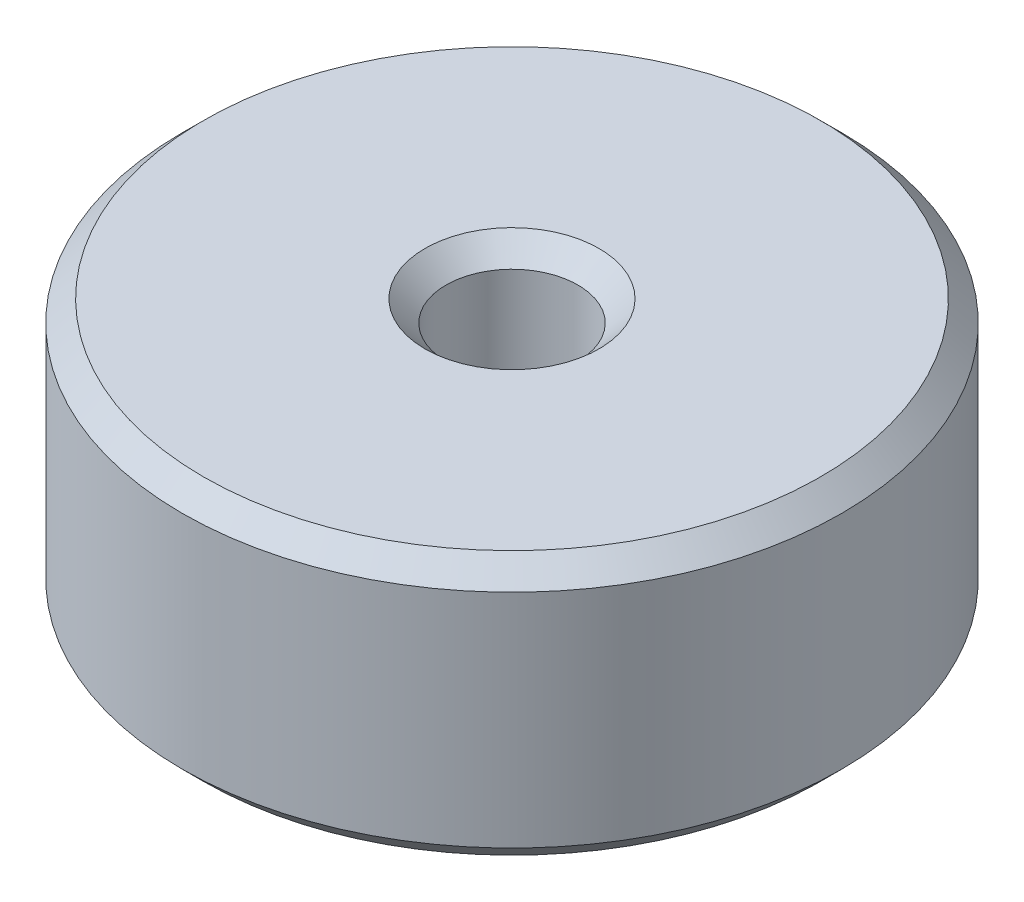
from build123d import *

# Parameters (mm, degrees)
SKETCH1_R           = 3.96875
SKETCH1_R_2         = 0.79375
BOSS_EXTRUDE1_DEPTH = 3.175
CHAMFER1_SIZE       = 0.254


with BuildPart() as part:
    # Sketch1 → Boss-Extrude1 (new body)
    with BuildSketch(Plane(origin=(0, 0, 0), x_dir=(1, 0, 0), z_dir=(0, 1, 0))):
        with Locations(Location((0, 0, 0), (0, 0, 270))):
            Circle(SKETCH1_R)
        with Locations(Location((0, 0, 0), (0, 0, 270))):
            Circle(SKETCH1_R_2, mode=Mode.SUBTRACT)
    extrude(amount=BOSS_EXTRUDE1_DEPTH)

    # Chamfer1
    chamfer1_edges = [part.edges().sort_by_distance(p)[0] for p in [
        (0, 0, -3.96875),
        (0, 3.175, -3.96875),
        (0, 0, -0.79375),
        (0, 3.175, -0.79375),
    ]]
    chamfer(chamfer1_edges, length=CHAMFER1_SIZE)


solid = part.part
